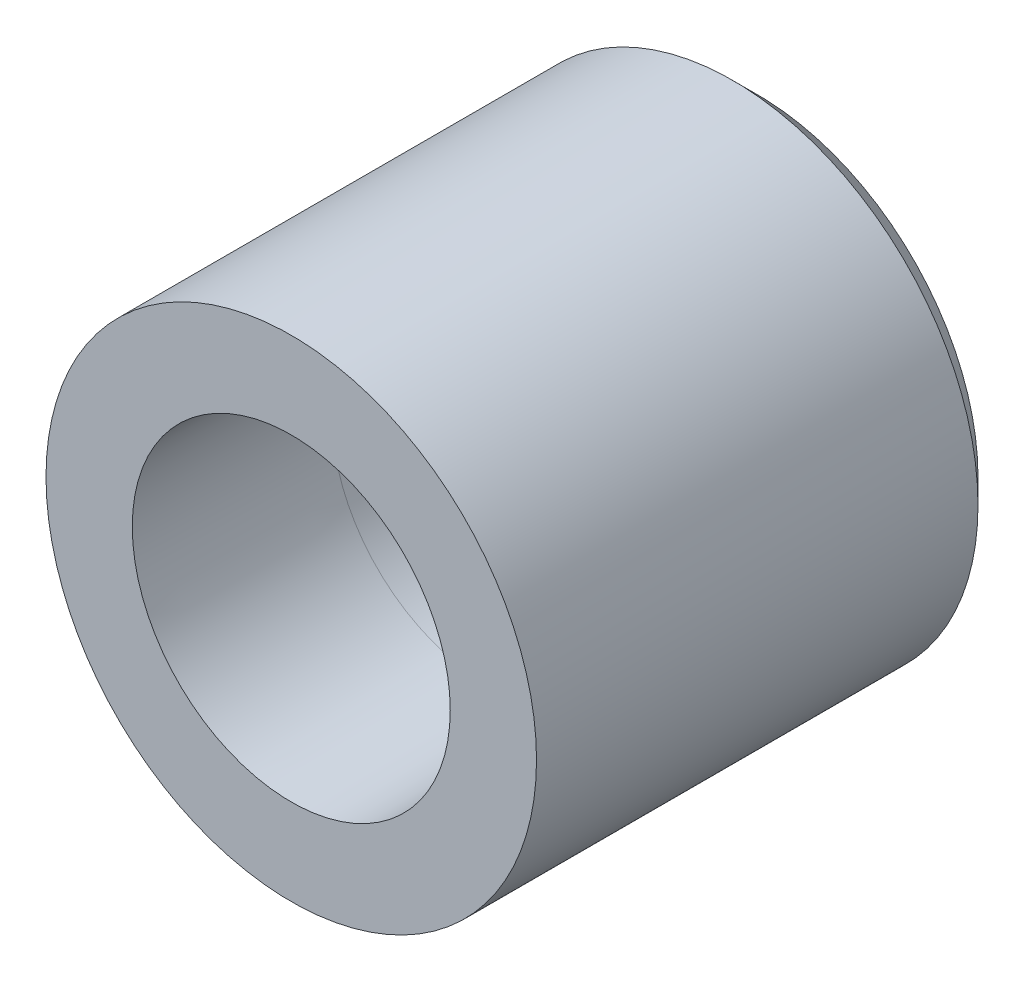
ISO-10303-21;
HEADER;
FILE_DESCRIPTION(('STEP AP214'),'2;1');
FILE_NAME('part.step','',(''),(''),'','','');
FILE_SCHEMA(('AUTOMOTIVE_DESIGN { 1 0 10303 214 1 1 1 1 }'));
ENDSEC;
DATA;
#1=APPLICATION_CONTEXT('core data for automotive mechanical design processes');
#2=APPLICATION_PROTOCOL_DEFINITION('international standard','automotive_design',2000,#1);
#3=PRODUCT_CONTEXT('',#1,'mechanical');
#4=PRODUCT('Part','Part','',(#3));
#5=PRODUCT_RELATED_PRODUCT_CATEGORY('part','',(#4));
#6=PRODUCT_DEFINITION_FORMATION('','',#4);
#7=PRODUCT_DEFINITION_CONTEXT('part definition',#1,'design');
#8=PRODUCT_DEFINITION('design','',#6,#7);
#9=PRODUCT_DEFINITION_SHAPE('','',#8);
#10=(LENGTH_UNIT() NAMED_UNIT(*) SI_UNIT(.MILLI.,.METRE.));
#11=(NAMED_UNIT(*) PLANE_ANGLE_UNIT() SI_UNIT($,.RADIAN.));
#12=(NAMED_UNIT(*) SI_UNIT($,.STERADIAN.) SOLID_ANGLE_UNIT());
#13=UNCERTAINTY_MEASURE_WITH_UNIT(LENGTH_MEASURE(1.E-05),#10,'distance_accuracy_value','');
#14=(GEOMETRIC_REPRESENTATION_CONTEXT(3) GLOBAL_UNCERTAINTY_ASSIGNED_CONTEXT((#13)) GLOBAL_UNIT_ASSIGNED_CONTEXT((#10,
#11,#12)) REPRESENTATION_CONTEXT('',''));
#15=CARTESIAN_POINT('',(0.,0.,0.));
#16=DIRECTION('',(0.,0.,1.));
#17=DIRECTION('',(1.,0.,0.));
#18=AXIS2_PLACEMENT_3D('',#15,#16,#17);
#19=CARTESIAN_POINT('',(0.,0.,-8.37268296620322));
#20=DIRECTION('',(0.,0.,1.));
#21=DIRECTION('',(1.,0.,0.));
#22=AXIS2_PLACEMENT_3D('',#19,#20,#21);
#23=CONICAL_SURFACE('',#22,8.97022144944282,0.785398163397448);
#24=CARTESIAN_POINT('',(0.,0.,-12.));
#25=DIRECTION('',(0.,0.,1.));
#26=DIRECTION('',(-1.,0.,0.));
#27=AXIS2_PLACEMENT_3D('',#24,#25,#26);
#28=CIRCLE('',#27,5.34290441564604);
#29=CARTESIAN_POINT('',(5.34290441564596,0.,-12.));
#30=VERTEX_POINT('',#29);
#31=CARTESIAN_POINT('',(-5.34290441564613,0.,-12.));
#32=VERTEX_POINT('',#31);
#33=EDGE_CURVE('E143',#30,#32,#28,.T.);
#34=ORIENTED_EDGE('',*,*,#33,.F.);
#35=CARTESIAN_POINT('',(5.34290115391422,0.,-12.0000032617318));
#36=CARTESIAN_POINT('',(6.34290215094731,0.,-11.0000022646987));
#37=B_SPLINE_CURVE_WITH_KNOTS('',1,(#35,#36),.UNSPECIFIED.,.F.,.F.,(2,2),(0.595626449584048,
0.707106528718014),.UNSPECIFIED.);
#38=CARTESIAN_POINT('',(6.34290441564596,0.,-11.));
#39=VERTEX_POINT('',#38);
#40=EDGE_CURVE('E44',#30,#39,#37,.T.);
#41=ORIENTED_EDGE('',*,*,#40,.T.);
#42=CARTESIAN_POINT('',(0.,0.,-11.));
#43=DIRECTION('',(0.,0.,-1.));
#44=DIRECTION('',(-1.,0.,0.));
#45=AXIS2_PLACEMENT_3D('',#42,#43,#44);
#46=CIRCLE('',#45,6.34290441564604);
#47=CARTESIAN_POINT('',(-6.34290441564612,0.,-11.));
#48=VERTEX_POINT('',#47);
#49=EDGE_CURVE('E11',#48,#39,#46,.T.);
#50=ORIENTED_EDGE('',*,*,#49,.F.);
#51=CARTESIAN_POINT('',(0.,0.,-11.));
#52=DIRECTION('',(0.,0.,-1.));
#53=DIRECTION('',(-1.,0.,0.));
#54=AXIS2_PLACEMENT_3D('',#51,#52,#53);
#55=CIRCLE('',#54,6.34290441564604);
#56=EDGE_CURVE('E51',#39,#48,#55,.T.);
#57=ORIENTED_EDGE('',*,*,#56,.F.);
#58=ORIENTED_EDGE('',*,*,#40,.F.);
#59=CARTESIAN_POINT('',(0.,0.,-12.));
#60=DIRECTION('',(0.,0.,1.));
#61=DIRECTION('',(-1.,0.,0.));
#62=AXIS2_PLACEMENT_3D('',#59,#60,#61);
#63=CIRCLE('',#62,5.34290441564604);
#64=EDGE_CURVE('E59',#32,#30,#63,.T.);
#65=ORIENTED_EDGE('',*,*,#64,.F.);
#66=EDGE_LOOP('',(#34,#41,#50,#57,#58,#65));
#67=FACE_BOUND('',#66,.T.);
#68=ADVANCED_FACE('F36',(#67),#23,.F.);
#69=CARTESIAN_POINT('',(0.,0.,-10.5));
#70=DIRECTION('',(0.,0.,-1.));
#71=DIRECTION('',(-1.,0.,0.));
#72=AXIS2_PLACEMENT_3D('',#69,#70,#71);
#73=CYLINDRICAL_SURFACE('',#72,6.34290441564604);
#74=CARTESIAN_POINT('',(0.,0.,-9.));
#75=DIRECTION('',(0.,0.,-1.));
#76=DIRECTION('',(-1.,0.,0.));
#77=AXIS2_PLACEMENT_3D('',#74,#75,#76);
#78=CIRCLE('',#77,6.34290441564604);
#79=CARTESIAN_POINT('',(-6.3429044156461,0.,-9.));
#80=VERTEX_POINT('',#79);
#81=EDGE_CURVE('E152',#80,#80,#78,.T.);
#82=ORIENTED_EDGE('',*,*,#81,.F.);
#83=CARTESIAN_POINT('',(-6.3429044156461,0.,-8.99999694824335));
#84=CARTESIAN_POINT('',(-6.34290441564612,0.,-11.000002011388));
#85=B_SPLINE_CURVE_WITH_KNOTS('',1,(#83,#84),.UNSPECIFIED.,.F.,.F.,(2,2),(0.0833320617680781,
0.91666750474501),.UNSPECIFIED.);
#86=EDGE_CURVE('E147',#80,#48,#85,.T.);
#87=ORIENTED_EDGE('',*,*,#86,.T.);
#88=ORIENTED_EDGE('',*,*,#49,.T.);
#89=ORIENTED_EDGE('',*,*,#56,.T.);
#90=ORIENTED_EDGE('',*,*,#86,.F.);
#91=EDGE_LOOP('',(#82,#87,#88,#89,#90));
#92=FACE_BOUND('',#91,.T.);
#93=ADVANCED_FACE('F191',(#92),#73,.F.);
#94=CARTESIAN_POINT('',(12.2886801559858,-11.1050182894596,-12.));
#95=DIRECTION('',(0.,0.,-1.));
#96=DIRECTION('',(-1.,0.,0.));
#97=AXIS2_PLACEMENT_3D('',#94,#95,#96);
#98=PLANE('',#97);
#99=CARTESIAN_POINT('',(-1.39659253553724E-13,0.,-11.9999999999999));
#100=DIRECTION('',(0.,0.,-1.));
#101=DIRECTION('',(-1.,0.,0.));
#102=AXIS2_PLACEMENT_3D('',#99,#100,#101);
#103=CIRCLE('',#102,2.49999999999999);
#104=CARTESIAN_POINT('',(-2.50000000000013,0.,-11.9999999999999));
#105=VERTEX_POINT('',#104);
#106=EDGE_CURVE('E103',#105,#105,#103,.T.);
#107=ORIENTED_EDGE('',*,*,#106,.T.);
#108=EDGE_LOOP('',(#107));
#109=FACE_BOUND('',#108,.T.);
#110=ORIENTED_EDGE('',*,*,#64,.T.);
#111=ORIENTED_EDGE('',*,*,#33,.T.);
#112=EDGE_LOOP('',(#110,#111));
#113=FACE_BOUND('',#112,.T.);
#114=ADVANCED_FACE('F193',(#109,#113),#98,.F.);
#115=CARTESIAN_POINT('',(0.,0.,-1.));
#116=DIRECTION('',(0.,0.,1.));
#117=DIRECTION('',(-1.,0.,0.));
#118=AXIS2_PLACEMENT_3D('',#115,#116,#117);
#119=CONICAL_SURFACE('',#118,6.48254493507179,0.0174532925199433);
#120=ORIENTED_EDGE('',*,*,#81,.T.);
#121=CARTESIAN_POINT('',(-6.34290441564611,0.,-9.));
#122=CARTESIAN_POINT('',(-6.48254493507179,0.,-0.999999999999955));
#123=B_SPLINE_CURVE_WITH_KNOTS('',1,(#121,#122),.UNSPECIFIED.,.F.,.F.,(2,2),(0.,1.),.UNSPECIFIED.);
#124=CARTESIAN_POINT('',(-6.48254493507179,0.,-0.999999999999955));
#125=VERTEX_POINT('',#124);
#126=EDGE_CURVE('E108',#80,#125,#123,.T.);
#127=ORIENTED_EDGE('',*,*,#126,.T.);
#128=CARTESIAN_POINT('',(0.,0.,-1.));
#129=DIRECTION('',(0.,0.,-1.));
#130=DIRECTION('',(1.,0.,0.));
#131=AXIS2_PLACEMENT_3D('',#128,#129,#130);
#132=CIRCLE('',#131,6.48254493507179);
#133=CARTESIAN_POINT('',(6.48254493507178,0.,-1.00000000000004));
#134=VERTEX_POINT('',#133);
#135=EDGE_CURVE('E133',#134,#125,#132,.T.);
#136=ORIENTED_EDGE('',*,*,#135,.F.);
#137=CARTESIAN_POINT('',(0.,0.,-1.));
#138=DIRECTION('',(0.,0.,-1.));
#139=DIRECTION('',(1.,0.,0.));
#140=AXIS2_PLACEMENT_3D('',#137,#138,#139);
#141=CIRCLE('',#140,6.48254493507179);
#142=EDGE_CURVE('E126',#125,#134,#141,.T.);
#143=ORIENTED_EDGE('',*,*,#142,.F.);
#144=ORIENTED_EDGE('',*,*,#126,.F.);
#145=EDGE_LOOP('',(#120,#127,#136,#143,#144));
#146=FACE_BOUND('',#145,.T.);
#147=ADVANCED_FACE('F189',(#146),#119,.F.);
#148=CARTESIAN_POINT('',(-1.03751912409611E-13,0.,-14.857864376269));
#149=DIRECTION('',(0.,0.,1.));
#150=DIRECTION('',(1.,0.,0.));
#151=AXIS2_PLACEMENT_3D('',#148,#149,#150);
#152=CONICAL_SURFACE('',#151,14.1421356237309,0.785398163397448);
#153=CARTESIAN_POINT('',(-1.39659253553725E-13,0.,-20.));
#154=DIRECTION('',(0.,0.,1.));
#155=DIRECTION('',(-1.,0.,0.));
#156=AXIS2_PLACEMENT_3D('',#153,#154,#155);
#157=CIRCLE('',#156,9.);
#158=CARTESIAN_POINT('',(-9.00000000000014,0.,-20.));
#159=VERTEX_POINT('',#158);
#160=CARTESIAN_POINT('',(8.99999999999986,0.,-20.));
#161=VERTEX_POINT('',#160);
#162=EDGE_CURVE('E90',#159,#161,#157,.T.);
#163=ORIENTED_EDGE('',*,*,#162,.T.);
#164=CARTESIAN_POINT('',(9.00000161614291,0.,-19.999998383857));
#165=CARTESIAN_POINT('',(10.0000008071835,0.,-18.9999991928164));
#166=B_SPLINE_CURVE_WITH_KNOTS('',1,(#164,#165),.UNSPECIFIED.,.F.,.F.,(2,2),(0.636396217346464,
0.707106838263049),.UNSPECIFIED.);
#167=CARTESIAN_POINT('',(9.99999999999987,0.,-19.));
#168=VERTEX_POINT('',#167);
#169=EDGE_CURVE('E95',#161,#168,#166,.T.);
#170=ORIENTED_EDGE('',*,*,#169,.T.);
#171=CARTESIAN_POINT('',(-1.32676290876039E-13,0.,-19.));
#172=DIRECTION('',(0.,0.,-1.));
#173=DIRECTION('',(-1.,0.,0.));
#174=AXIS2_PLACEMENT_3D('',#171,#172,#173);
#175=CIRCLE('',#174,10.);
#176=CARTESIAN_POINT('',(-10.0000000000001,0.,-19.));
#177=VERTEX_POINT('',#176);
#178=EDGE_CURVE('E102',#168,#177,#175,.T.);
#179=ORIENTED_EDGE('',*,*,#178,.T.);
#180=CARTESIAN_POINT('',(-1.32676290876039E-13,0.,-19.));
#181=DIRECTION('',(0.,0.,-1.));
#182=DIRECTION('',(-1.,0.,0.));
#183=AXIS2_PLACEMENT_3D('',#180,#181,#182);
#184=CIRCLE('',#183,10.);
#185=EDGE_CURVE('E105',#177,#168,#184,.T.);
#186=ORIENTED_EDGE('',*,*,#185,.T.);
#187=ORIENTED_EDGE('',*,*,#169,.F.);
#188=CARTESIAN_POINT('',(-1.39659253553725E-13,0.,-20.));
#189=DIRECTION('',(0.,0.,1.));
#190=DIRECTION('',(-1.,0.,0.));
#191=AXIS2_PLACEMENT_3D('',#188,#189,#190);
#192=CIRCLE('',#191,9.);
#193=EDGE_CURVE('E97',#161,#159,#192,.T.);
#194=ORIENTED_EDGE('',*,*,#193,.T.);
#195=EDGE_LOOP('',(#163,#170,#179,#186,#187,#194));
#196=FACE_BOUND('',#195,.T.);
#197=ADVANCED_FACE('F92',(#196),#152,.T.);
#198=CARTESIAN_POINT('',(0.,0.,-10.5));
#199=DIRECTION('',(0.,0.,-1.));
#200=DIRECTION('',(-1.,0.,0.));
#201=AXIS2_PLACEMENT_3D('',#198,#199,#200);
#202=CYLINDRICAL_SURFACE('',#201,10.);
#203=CARTESIAN_POINT('',(0.,0.,-1.));
#204=DIRECTION('',(0.,0.,1.));
#205=DIRECTION('',(-1.,0.,0.));
#206=AXIS2_PLACEMENT_3D('',#203,#204,#205);
#207=CIRCLE('',#206,10.);
#208=CARTESIAN_POINT('',(-10.,0.,-0.99999999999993));
#209=VERTEX_POINT('',#208);
#210=EDGE_CURVE('E99',#209,#209,#207,.T.);
#211=ORIENTED_EDGE('',*,*,#210,.F.);
#212=CARTESIAN_POINT('',(-10.,0.,-1.00000137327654));
#213=CARTESIAN_POINT('',(-10.0000000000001,0.,-19.0000018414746));
#214=B_SPLINE_CURVE_WITH_KNOTS('',1,(#212,#213),.UNSPECIFIED.,.F.,.F.,(2,2),(0.0833333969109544,
0.916666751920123),.UNSPECIFIED.);
#215=EDGE_CURVE('E173',#209,#177,#214,.T.);
#216=ORIENTED_EDGE('',*,*,#215,.T.);
#217=ORIENTED_EDGE('',*,*,#178,.F.);
#218=ORIENTED_EDGE('',*,*,#185,.F.);
#219=ORIENTED_EDGE('',*,*,#215,.F.);
#220=EDGE_LOOP('',(#211,#216,#217,#218,#219));
#221=FACE_BOUND('',#220,.T.);
#222=ADVANCED_FACE('F225',(#221),#202,.T.);
#223=CARTESIAN_POINT('',(20.7,-18.7061487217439,-20.));
#224=DIRECTION('',(0.,0.,-1.));
#225=DIRECTION('',(-1.,0.,0.));
#226=AXIS2_PLACEMENT_3D('',#223,#224,#225);
#227=PLANE('',#226);
#228=CARTESIAN_POINT('',(-1.39659253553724E-13,0.,-19.9999999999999));
#229=DIRECTION('',(0.,0.,-1.));
#230=DIRECTION('',(-1.,0.,0.));
#231=AXIS2_PLACEMENT_3D('',#228,#229,#230);
#232=CIRCLE('',#231,2.49999999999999);
#233=CARTESIAN_POINT('',(-2.50000000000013,0.,-19.9999999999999));
#234=VERTEX_POINT('',#233);
#235=EDGE_CURVE('E275',#234,#234,#232,.T.);
#236=ORIENTED_EDGE('',*,*,#235,.F.);
#237=EDGE_LOOP('',(#236));
#238=FACE_BOUND('',#237,.T.);
#239=ORIENTED_EDGE('',*,*,#193,.F.);
#240=ORIENTED_EDGE('',*,*,#162,.F.);
#241=EDGE_LOOP('',(#239,#240));
#242=FACE_BOUND('',#241,.T.);
#243=ADVANCED_FACE('F101',(#238,#242),#227,.T.);
#244=CARTESIAN_POINT('',(-13.,-20.7846096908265,-0.999999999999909));
#245=DIRECTION('',(0.,0.,1.));
#246=DIRECTION('',(1.,0.,0.));
#247=AXIS2_PLACEMENT_3D('',#244,#245,#246);
#248=PLANE('',#247);
#249=ORIENTED_EDGE('',*,*,#210,.T.);
#250=EDGE_LOOP('',(#249));
#251=FACE_BOUND('',#250,.T.);
#252=ORIENTED_EDGE('',*,*,#135,.T.);
#253=ORIENTED_EDGE('',*,*,#142,.T.);
#254=EDGE_LOOP('',(#252,#253));
#255=FACE_BOUND('',#254,.T.);
#256=ADVANCED_FACE('F240',(#251,#255),#248,.T.);
#257=CARTESIAN_POINT('',(-1.39659253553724E-13,0.,-19.9999999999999));
#258=DIRECTION('',(0.,0.,-1.));
#259=DIRECTION('',(-1.,0.,0.));
#260=AXIS2_PLACEMENT_3D('',#257,#258,#259);
#261=CYLINDRICAL_SURFACE('',#260,2.49999999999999);
#262=ORIENTED_EDGE('',*,*,#235,.T.);
#263=EDGE_LOOP('',(#262));
#264=FACE_BOUND('',#263,.T.);
#265=ORIENTED_EDGE('',*,*,#106,.F.);
#266=EDGE_LOOP('',(#265));
#267=FACE_BOUND('',#266,.T.);
#268=ADVANCED_FACE('F248',(#264,#267),#261,.F.);
#269=CLOSED_SHELL('',(#68,#93,#114,#147,#197,#222,#243,#256,#268));
#270=MANIFOLD_SOLID_BREP('B2',#269);
#271=ADVANCED_BREP_SHAPE_REPRESENTATION('',(#18,#270),#14);
#272=SHAPE_DEFINITION_REPRESENTATION(#9,#271);
ENDSEC;
END-ISO-10303-21;
